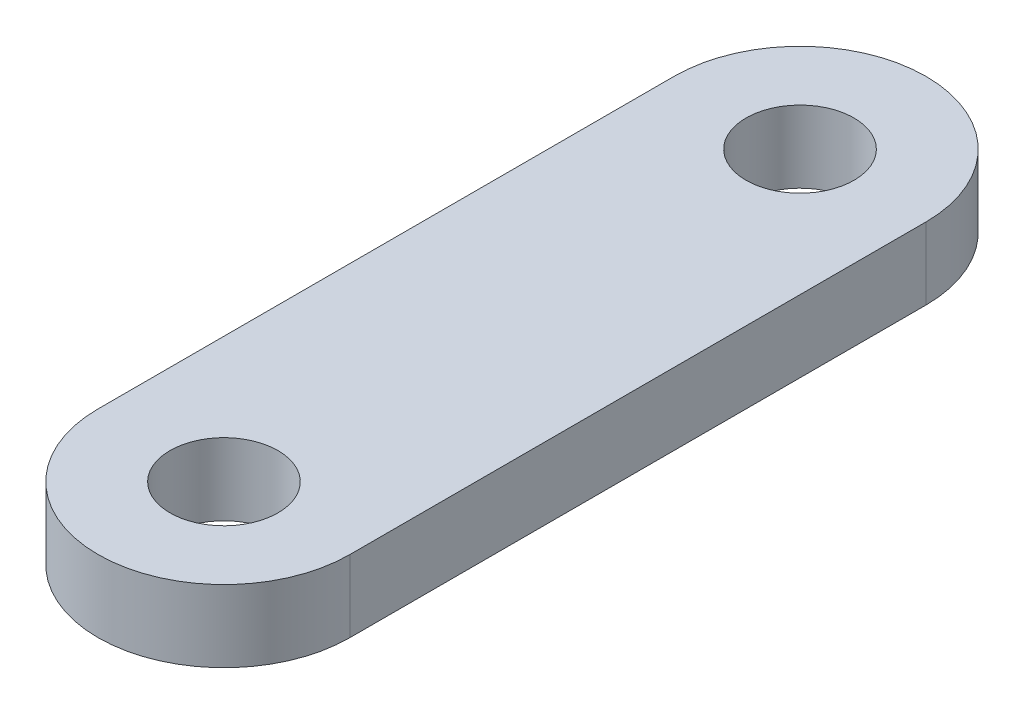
from build123d import *

# Parameters (mm, degrees)
SKETCH1_R           = 1.5
BOSS_EXTRUDE1_DEPTH = 2


with BuildPart() as part:
    # Sketch1 → Boss-Extrude1 (new body)
    with BuildSketch(Plane(origin=(0, 0, 0), x_dir=(1, 0, 0), z_dir=(0, 1, 0))):
        with BuildLine():
            Line((-3.5, 8), (-3.5, 0))
            Line((-3.5, 0), (3.5, 0))
            Line((3.5, 0), (3.5, 8))
            ThreePointArc((3.5, 8), (0, 11.5), (-3.5, 8))
        make_face()
        with Locations(Location((0, 8, 0), (0, 0, 270))):
            Circle(SKETCH1_R, mode=Mode.SUBTRACT)
    extrude(amount=BOSS_EXTRUDE1_DEPTH)

    # Mirror1: part across plane


with BuildPart() as part_1:
    add(part.part)
    add(part.part.mirror(Plane(origin=(-3.5, 2, 0), x_dir=(1, 0, 0), z_dir=(0, 0, -1))))


solid = part_1.part
